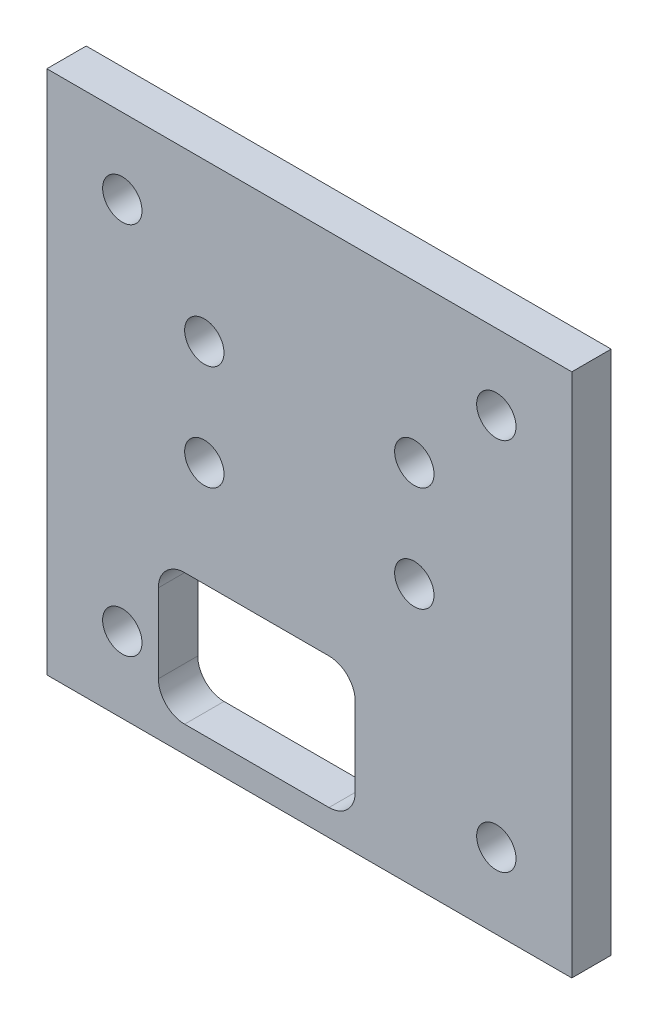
ISO-10303-21;
HEADER;
FILE_DESCRIPTION(('STEP AP214'),'2;1');
FILE_NAME('part.step','',(''),(''),'','','');
FILE_SCHEMA(('AUTOMOTIVE_DESIGN { 1 0 10303 214 1 1 1 1 }'));
ENDSEC;
DATA;
#1=APPLICATION_CONTEXT('core data for automotive mechanical design processes');
#2=APPLICATION_PROTOCOL_DEFINITION('international standard','automotive_design',2000,#1);
#3=PRODUCT_CONTEXT('',#1,'mechanical');
#4=PRODUCT('Part','Part','',(#3));
#5=PRODUCT_RELATED_PRODUCT_CATEGORY('part','',(#4));
#6=PRODUCT_DEFINITION_FORMATION('','',#4);
#7=PRODUCT_DEFINITION_CONTEXT('part definition',#1,'design');
#8=PRODUCT_DEFINITION('design','',#6,#7);
#9=PRODUCT_DEFINITION_SHAPE('','',#8);
#10=(LENGTH_UNIT() NAMED_UNIT(*) SI_UNIT(.MILLI.,.METRE.));
#11=(NAMED_UNIT(*) PLANE_ANGLE_UNIT() SI_UNIT($,.RADIAN.));
#12=(NAMED_UNIT(*) SI_UNIT($,.STERADIAN.) SOLID_ANGLE_UNIT());
#13=UNCERTAINTY_MEASURE_WITH_UNIT(LENGTH_MEASURE(1.E-05),#10,'distance_accuracy_value','');
#14=(GEOMETRIC_REPRESENTATION_CONTEXT(3) GLOBAL_UNCERTAINTY_ASSIGNED_CONTEXT((#13)) GLOBAL_UNIT_ASSIGNED_CONTEXT((#10,
#11,#12)) REPRESENTATION_CONTEXT('',''));
#15=CARTESIAN_POINT('',(0.,0.,0.));
#16=DIRECTION('',(0.,0.,1.));
#17=DIRECTION('',(1.,0.,0.));
#18=AXIS2_PLACEMENT_3D('',#15,#16,#17);
#19=CARTESIAN_POINT('',(20.,20.,3.));
#20=DIRECTION('',(-1.,0.,0.));
#21=DIRECTION('',(0.,-1.,0.));
#22=AXIS2_PLACEMENT_3D('',#19,#20,#21);
#23=PLANE('',#22);
#24=DIRECTION('',(0.,1.,0.));
#25=VECTOR('',#24,1.);
#26=CARTESIAN_POINT('',(20.,20.,0.));
#27=LINE('',#26,#25);
#28=CARTESIAN_POINT('',(20.,-20.,0.));
#29=VERTEX_POINT('',#28);
#30=CARTESIAN_POINT('',(20.,20.,0.));
#31=VERTEX_POINT('',#30);
#32=EDGE_CURVE('E148',#29,#31,#27,.T.);
#33=ORIENTED_EDGE('',*,*,#32,.T.);
#34=DIRECTION('',(0.,0.,-1.));
#35=VECTOR('',#34,1.);
#36=CARTESIAN_POINT('',(20.,20.,3.));
#37=LINE('',#36,#35);
#38=CARTESIAN_POINT('',(20.,20.,3.));
#39=VERTEX_POINT('',#38);
#40=EDGE_CURVE('E129',#39,#31,#37,.T.);
#41=ORIENTED_EDGE('',*,*,#40,.F.);
#42=DIRECTION('',(0.,1.,0.));
#43=VECTOR('',#42,1.);
#44=CARTESIAN_POINT('',(20.,20.,3.));
#45=LINE('',#44,#43);
#46=CARTESIAN_POINT('',(20.,-20.,3.));
#47=VERTEX_POINT('',#46);
#48=EDGE_CURVE('E136',#47,#39,#45,.T.);
#49=ORIENTED_EDGE('',*,*,#48,.F.);
#50=DIRECTION('',(0.,0.,-1.));
#51=VECTOR('',#50,1.);
#52=CARTESIAN_POINT('',(20.,-20.,3.));
#53=LINE('',#52,#51);
#54=EDGE_CURVE('E252',#47,#29,#53,.T.);
#55=ORIENTED_EDGE('',*,*,#54,.T.);
#56=EDGE_LOOP('',(#33,#41,#49,#55));
#57=FACE_BOUND('',#56,.T.);
#58=ADVANCED_FACE('F35',(#57),#23,.F.);
#59=CARTESIAN_POINT('',(-20.,20.,3.));
#60=DIRECTION('',(0.,-1.,0.));
#61=DIRECTION('',(0.,0.,-1.));
#62=AXIS2_PLACEMENT_3D('',#59,#60,#61);
#63=PLANE('',#62);
#64=DIRECTION('',(-1.,0.,0.));
#65=VECTOR('',#64,1.);
#66=CARTESIAN_POINT('',(-20.,20.,0.));
#67=LINE('',#66,#65);
#68=CARTESIAN_POINT('',(-20.,20.,0.));
#69=VERTEX_POINT('',#68);
#70=EDGE_CURVE('E254',#31,#69,#67,.T.);
#71=ORIENTED_EDGE('',*,*,#70,.T.);
#72=DIRECTION('',(0.,0.,-1.));
#73=VECTOR('',#72,1.);
#74=CARTESIAN_POINT('',(-20.,20.,3.));
#75=LINE('',#74,#73);
#76=CARTESIAN_POINT('',(-20.,20.,3.));
#77=VERTEX_POINT('',#76);
#78=EDGE_CURVE('E132',#77,#69,#75,.T.);
#79=ORIENTED_EDGE('',*,*,#78,.F.);
#80=DIRECTION('',(-1.,0.,0.));
#81=VECTOR('',#80,1.);
#82=CARTESIAN_POINT('',(-20.,20.,3.));
#83=LINE('',#82,#81);
#84=EDGE_CURVE('E125',#39,#77,#83,.T.);
#85=ORIENTED_EDGE('',*,*,#84,.F.);
#86=ORIENTED_EDGE('',*,*,#40,.T.);
#87=EDGE_LOOP('',(#71,#79,#85,#86));
#88=FACE_BOUND('',#87,.T.);
#89=ADVANCED_FACE('F127',(#88),#63,.F.);
#90=CARTESIAN_POINT('',(-20.,20.,3.));
#91=DIRECTION('',(1.,0.,0.));
#92=DIRECTION('',(0.,1.,0.));
#93=AXIS2_PLACEMENT_3D('',#90,#91,#92);
#94=PLANE('',#93);
#95=DIRECTION('',(0.,-1.,0.));
#96=VECTOR('',#95,1.);
#97=CARTESIAN_POINT('',(-20.,20.,0.));
#98=LINE('',#97,#96);
#99=CARTESIAN_POINT('',(-20.,-20.,0.));
#100=VERTEX_POINT('',#99);
#101=EDGE_CURVE('E256',#69,#100,#98,.T.);
#102=ORIENTED_EDGE('',*,*,#101,.T.);
#103=DIRECTION('',(0.,0.,-1.));
#104=VECTOR('',#103,1.);
#105=CARTESIAN_POINT('',(-20.,-20.,3.));
#106=LINE('',#105,#104);
#107=CARTESIAN_POINT('',(-20.,-20.,3.));
#108=VERTEX_POINT('',#107);
#109=EDGE_CURVE('E153',#108,#100,#106,.T.);
#110=ORIENTED_EDGE('',*,*,#109,.F.);
#111=DIRECTION('',(0.,-1.,0.));
#112=VECTOR('',#111,1.);
#113=CARTESIAN_POINT('',(-20.,20.,3.));
#114=LINE('',#113,#112);
#115=EDGE_CURVE('E135',#77,#108,#114,.T.);
#116=ORIENTED_EDGE('',*,*,#115,.F.);
#117=ORIENTED_EDGE('',*,*,#78,.T.);
#118=EDGE_LOOP('',(#102,#110,#116,#117));
#119=FACE_BOUND('',#118,.T.);
#120=ADVANCED_FACE('F267',(#119),#94,.F.);
#121=CARTESIAN_POINT('',(-20.,-20.,3.));
#122=DIRECTION('',(0.,1.,0.));
#123=DIRECTION('',(0.,0.,1.));
#124=AXIS2_PLACEMENT_3D('',#121,#122,#123);
#125=PLANE('',#124);
#126=DIRECTION('',(1.,0.,0.));
#127=VECTOR('',#126,1.);
#128=CARTESIAN_POINT('',(-20.,-20.,0.));
#129=LINE('',#128,#127);
#130=EDGE_CURVE('E145',#100,#29,#129,.T.);
#131=ORIENTED_EDGE('',*,*,#130,.T.);
#132=ORIENTED_EDGE('',*,*,#54,.F.);
#133=DIRECTION('',(1.,0.,0.));
#134=VECTOR('',#133,1.);
#135=CARTESIAN_POINT('',(-20.,-20.,3.));
#136=LINE('',#135,#134);
#137=EDGE_CURVE('E141',#108,#47,#136,.T.);
#138=ORIENTED_EDGE('',*,*,#137,.F.);
#139=ORIENTED_EDGE('',*,*,#109,.T.);
#140=EDGE_LOOP('',(#131,#132,#138,#139));
#141=FACE_BOUND('',#140,.T.);
#142=ADVANCED_FACE('F263',(#141),#125,.F.);
#143=CARTESIAN_POINT('',(0.,0.,3.));
#144=DIRECTION('',(0.,0.,1.));
#145=DIRECTION('',(1.,0.,0.));
#146=AXIS2_PLACEMENT_3D('',#143,#144,#145);
#147=PLANE('',#146);
#148=CARTESIAN_POINT('',(-8.,8.,3.));
#149=DIRECTION('',(0.,0.,1.));
#150=DIRECTION('',(1.,0.,0.));
#151=AXIS2_PLACEMENT_3D('',#148,#149,#150);
#152=CIRCLE('',#151,1.5);
#153=CARTESIAN_POINT('',(-6.5,8.,3.));
#154=VERTEX_POINT('',#153);
#155=EDGE_CURVE('E321',#154,#154,#152,.T.);
#156=ORIENTED_EDGE('',*,*,#155,.F.);
#157=EDGE_LOOP('',(#156));
#158=FACE_BOUND('',#157,.T.);
#159=CARTESIAN_POINT('',(-8.,0.,3.));
#160=DIRECTION('',(0.,0.,1.));
#161=DIRECTION('',(1.,0.,0.));
#162=AXIS2_PLACEMENT_3D('',#159,#160,#161);
#163=CIRCLE('',#162,1.5);
#164=CARTESIAN_POINT('',(-6.5,0.,3.));
#165=VERTEX_POINT('',#164);
#166=EDGE_CURVE('E315',#165,#165,#163,.T.);
#167=ORIENTED_EDGE('',*,*,#166,.F.);
#168=EDGE_LOOP('',(#167));
#169=FACE_BOUND('',#168,.T.);
#170=CARTESIAN_POINT('',(8.,0.,3.));
#171=DIRECTION('',(0.,0.,1.));
#172=DIRECTION('',(1.,0.,0.));
#173=AXIS2_PLACEMENT_3D('',#170,#171,#172);
#174=CIRCLE('',#173,1.5);
#175=CARTESIAN_POINT('',(9.5,0.,3.));
#176=VERTEX_POINT('',#175);
#177=EDGE_CURVE('E309',#176,#176,#174,.T.);
#178=ORIENTED_EDGE('',*,*,#177,.F.);
#179=EDGE_LOOP('',(#178));
#180=FACE_BOUND('',#179,.T.);
#181=CARTESIAN_POINT('',(8.,8.,3.));
#182=DIRECTION('',(0.,0.,1.));
#183=DIRECTION('',(1.,0.,0.));
#184=AXIS2_PLACEMENT_3D('',#181,#182,#183);
#185=CIRCLE('',#184,1.5);
#186=CARTESIAN_POINT('',(9.5,8.,3.));
#187=VERTEX_POINT('',#186);
#188=EDGE_CURVE('E303',#187,#187,#185,.T.);
#189=ORIENTED_EDGE('',*,*,#188,.F.);
#190=EDGE_LOOP('',(#189));
#191=FACE_BOUND('',#190,.T.);
#192=DIRECTION('',(0.,1.,0.));
#193=VECTOR('',#192,1.);
#194=CARTESIAN_POINT('',(3.5,-8.,3.));
#195=LINE('',#194,#193);
#196=CARTESIAN_POINT('',(3.5,-16.,3.));
#197=VERTEX_POINT('',#196);
#198=CARTESIAN_POINT('',(3.5,-10.,3.));
#199=VERTEX_POINT('',#198);
#200=EDGE_CURVE('E210',#197,#199,#195,.T.);
#201=ORIENTED_EDGE('',*,*,#200,.F.);
#202=CARTESIAN_POINT('',(1.5,-16.,3.));
#203=DIRECTION('',(0.,0.,1.));
#204=DIRECTION('',(1.,0.,0.));
#205=AXIS2_PLACEMENT_3D('',#202,#203,#204);
#206=CIRCLE('',#205,2.);
#207=CARTESIAN_POINT('',(1.5,-18.,3.));
#208=VERTEX_POINT('',#207);
#209=EDGE_CURVE('E191',#197,#208,#206,.F.);
#210=ORIENTED_EDGE('',*,*,#209,.T.);
#211=DIRECTION('',(1.,0.,0.));
#212=VECTOR('',#211,1.);
#213=CARTESIAN_POINT('',(-11.5,-18.,3.));
#214=LINE('',#213,#212);
#215=CARTESIAN_POINT('',(-9.5,-18.,3.));
#216=VERTEX_POINT('',#215);
#217=EDGE_CURVE('E233',#216,#208,#214,.T.);
#218=ORIENTED_EDGE('',*,*,#217,.F.);
#219=CARTESIAN_POINT('',(-9.5,-16.,3.));
#220=DIRECTION('',(0.,0.,1.));
#221=DIRECTION('',(1.,0.,0.));
#222=AXIS2_PLACEMENT_3D('',#219,#220,#221);
#223=CIRCLE('',#222,2.);
#224=CARTESIAN_POINT('',(-11.5,-16.,3.));
#225=VERTEX_POINT('',#224);
#226=EDGE_CURVE('E183',#216,#225,#223,.F.);
#227=ORIENTED_EDGE('',*,*,#226,.T.);
#228=DIRECTION('',(0.,-1.,0.));
#229=VECTOR('',#228,1.);
#230=CARTESIAN_POINT('',(-11.5,-8.,3.));
#231=LINE('',#230,#229);
#232=CARTESIAN_POINT('',(-11.5,-10.,3.));
#233=VERTEX_POINT('',#232);
#234=EDGE_CURVE('E201',#233,#225,#231,.T.);
#235=ORIENTED_EDGE('',*,*,#234,.F.);
#236=CARTESIAN_POINT('',(-9.5,-10.,3.));
#237=DIRECTION('',(0.,0.,1.));
#238=DIRECTION('',(1.,0.,0.));
#239=AXIS2_PLACEMENT_3D('',#236,#237,#238);
#240=CIRCLE('',#239,2.);
#241=CARTESIAN_POINT('',(-9.5,-8.,3.));
#242=VERTEX_POINT('',#241);
#243=EDGE_CURVE('E43',#233,#242,#240,.F.);
#244=ORIENTED_EDGE('',*,*,#243,.T.);
#245=DIRECTION('',(-1.,0.,0.));
#246=VECTOR('',#245,1.);
#247=CARTESIAN_POINT('',(-11.5,-8.,3.));
#248=LINE('',#247,#246);
#249=CARTESIAN_POINT('',(1.5,-8.,3.));
#250=VERTEX_POINT('',#249);
#251=EDGE_CURVE('E199',#250,#242,#248,.T.);
#252=ORIENTED_EDGE('',*,*,#251,.F.);
#253=CARTESIAN_POINT('',(1.5,-10.,3.));
#254=DIRECTION('',(0.,0.,1.));
#255=DIRECTION('',(1.,0.,0.));
#256=AXIS2_PLACEMENT_3D('',#253,#254,#255);
#257=CIRCLE('',#256,2.);
#258=EDGE_CURVE('E187',#250,#199,#257,.F.);
#259=ORIENTED_EDGE('',*,*,#258,.T.);
#260=EDGE_LOOP('',(#201,#210,#218,#227,#235,#244,#252,#259));
#261=FACE_BOUND('',#260,.T.);
#262=CARTESIAN_POINT('',(-14.25,14.25,3.));
#263=DIRECTION('',(0.,0.,1.));
#264=DIRECTION('',(1.,0.,0.));
#265=AXIS2_PLACEMENT_3D('',#262,#263,#264);
#266=CIRCLE('',#265,1.5);
#267=CARTESIAN_POINT('',(-12.75,14.25,3.));
#268=VERTEX_POINT('',#267);
#269=EDGE_CURVE('E165',#268,#268,#266,.T.);
#270=ORIENTED_EDGE('',*,*,#269,.F.);
#271=EDGE_LOOP('',(#270));
#272=FACE_BOUND('',#271,.T.);
#273=CARTESIAN_POINT('',(14.25,14.25,3.));
#274=DIRECTION('',(0.,0.,1.));
#275=DIRECTION('',(1.,0.,0.));
#276=AXIS2_PLACEMENT_3D('',#273,#274,#275);
#277=CIRCLE('',#276,1.5);
#278=CARTESIAN_POINT('',(15.75,14.25,3.));
#279=VERTEX_POINT('',#278);
#280=EDGE_CURVE('E164',#279,#279,#277,.T.);
#281=ORIENTED_EDGE('',*,*,#280,.F.);
#282=EDGE_LOOP('',(#281));
#283=FACE_BOUND('',#282,.T.);
#284=CARTESIAN_POINT('',(14.25,-14.25,3.));
#285=DIRECTION('',(0.,0.,1.));
#286=DIRECTION('',(1.,0.,0.));
#287=AXIS2_PLACEMENT_3D('',#284,#285,#286);
#288=CIRCLE('',#287,1.5);
#289=CARTESIAN_POINT('',(15.75,-14.25,3.));
#290=VERTEX_POINT('',#289);
#291=EDGE_CURVE('E161',#290,#290,#288,.T.);
#292=ORIENTED_EDGE('',*,*,#291,.F.);
#293=EDGE_LOOP('',(#292));
#294=FACE_BOUND('',#293,.T.);
#295=CARTESIAN_POINT('',(-14.25,-14.25,3.));
#296=DIRECTION('',(0.,0.,1.));
#297=DIRECTION('',(1.,0.,0.));
#298=AXIS2_PLACEMENT_3D('',#295,#296,#297);
#299=CIRCLE('',#298,1.5);
#300=CARTESIAN_POINT('',(-12.75,-14.25,3.));
#301=VERTEX_POINT('',#300);
#302=EDGE_CURVE('E160',#301,#301,#299,.T.);
#303=ORIENTED_EDGE('',*,*,#302,.F.);
#304=EDGE_LOOP('',(#303));
#305=FACE_BOUND('',#304,.T.);
#306=ORIENTED_EDGE('',*,*,#48,.T.);
#307=ORIENTED_EDGE('',*,*,#84,.T.);
#308=ORIENTED_EDGE('',*,*,#115,.T.);
#309=ORIENTED_EDGE('',*,*,#137,.T.);
#310=EDGE_LOOP('',(#306,#307,#308,#309));
#311=FACE_BOUND('',#310,.T.);
#312=ADVANCED_FACE('F139',(#158,#169,#180,#191,#261,#272,#283,#294,#305,#311),#147,.T.);
#313=CARTESIAN_POINT('',(0.,0.,0.));
#314=DIRECTION('',(0.,0.,1.));
#315=DIRECTION('',(1.,0.,0.));
#316=AXIS2_PLACEMENT_3D('',#313,#314,#315);
#317=PLANE('',#316);
#318=CARTESIAN_POINT('',(-8.,8.,0.));
#319=DIRECTION('',(0.,0.,1.));
#320=DIRECTION('',(1.,0.,0.));
#321=AXIS2_PLACEMENT_3D('',#318,#319,#320);
#322=CIRCLE('',#321,1.5);
#323=CARTESIAN_POINT('',(-6.5,8.,0.));
#324=VERTEX_POINT('',#323);
#325=EDGE_CURVE('E318',#324,#324,#322,.T.);
#326=ORIENTED_EDGE('',*,*,#325,.T.);
#327=EDGE_LOOP('',(#326));
#328=FACE_BOUND('',#327,.T.);
#329=CARTESIAN_POINT('',(-8.,0.,0.));
#330=DIRECTION('',(0.,0.,1.));
#331=DIRECTION('',(1.,0.,0.));
#332=AXIS2_PLACEMENT_3D('',#329,#330,#331);
#333=CIRCLE('',#332,1.5);
#334=CARTESIAN_POINT('',(-6.5,0.,0.));
#335=VERTEX_POINT('',#334);
#336=EDGE_CURVE('E312',#335,#335,#333,.T.);
#337=ORIENTED_EDGE('',*,*,#336,.T.);
#338=EDGE_LOOP('',(#337));
#339=FACE_BOUND('',#338,.T.);
#340=CARTESIAN_POINT('',(8.,0.,0.));
#341=DIRECTION('',(0.,0.,1.));
#342=DIRECTION('',(1.,0.,0.));
#343=AXIS2_PLACEMENT_3D('',#340,#341,#342);
#344=CIRCLE('',#343,1.5);
#345=CARTESIAN_POINT('',(9.5,0.,0.));
#346=VERTEX_POINT('',#345);
#347=EDGE_CURVE('E306',#346,#346,#344,.T.);
#348=ORIENTED_EDGE('',*,*,#347,.T.);
#349=EDGE_LOOP('',(#348));
#350=FACE_BOUND('',#349,.T.);
#351=CARTESIAN_POINT('',(8.,8.,0.));
#352=DIRECTION('',(0.,0.,1.));
#353=DIRECTION('',(1.,0.,0.));
#354=AXIS2_PLACEMENT_3D('',#351,#352,#353);
#355=CIRCLE('',#354,1.5);
#356=CARTESIAN_POINT('',(9.5,8.,0.));
#357=VERTEX_POINT('',#356);
#358=EDGE_CURVE('E230',#357,#357,#355,.T.);
#359=ORIENTED_EDGE('',*,*,#358,.T.);
#360=EDGE_LOOP('',(#359));
#361=FACE_BOUND('',#360,.T.);
#362=DIRECTION('',(0.,-1.,0.));
#363=VECTOR('',#362,1.);
#364=CARTESIAN_POINT('',(-11.5,-8.,0.));
#365=LINE('',#364,#363);
#366=CARTESIAN_POINT('',(-11.5,-10.,0.));
#367=VERTEX_POINT('',#366);
#368=CARTESIAN_POINT('',(-11.5,-16.,0.));
#369=VERTEX_POINT('',#368);
#370=EDGE_CURVE('E217',#367,#369,#365,.T.);
#371=ORIENTED_EDGE('',*,*,#370,.T.);
#372=CARTESIAN_POINT('',(-9.5,-16.,0.));
#373=DIRECTION('',(0.,0.,1.));
#374=DIRECTION('',(1.,0.,0.));
#375=AXIS2_PLACEMENT_3D('',#372,#373,#374);
#376=CIRCLE('',#375,2.);
#377=CARTESIAN_POINT('',(-9.5,-18.,0.));
#378=VERTEX_POINT('',#377);
#379=EDGE_CURVE('E185',#369,#378,#376,.T.);
#380=ORIENTED_EDGE('',*,*,#379,.T.);
#381=DIRECTION('',(1.,0.,0.));
#382=VECTOR('',#381,1.);
#383=CARTESIAN_POINT('',(-11.5,-18.,0.));
#384=LINE('',#383,#382);
#385=CARTESIAN_POINT('',(1.5,-18.,0.));
#386=VERTEX_POINT('',#385);
#387=EDGE_CURVE('E223',#378,#386,#384,.T.);
#388=ORIENTED_EDGE('',*,*,#387,.T.);
#389=CARTESIAN_POINT('',(1.5,-16.,0.));
#390=DIRECTION('',(0.,0.,1.));
#391=DIRECTION('',(1.,0.,0.));
#392=AXIS2_PLACEMENT_3D('',#389,#390,#391);
#393=CIRCLE('',#392,2.);
#394=CARTESIAN_POINT('',(3.5,-16.,0.));
#395=VERTEX_POINT('',#394);
#396=EDGE_CURVE('E57',#386,#395,#393,.T.);
#397=ORIENTED_EDGE('',*,*,#396,.T.);
#398=DIRECTION('',(0.,1.,0.));
#399=VECTOR('',#398,1.);
#400=CARTESIAN_POINT('',(3.5,-8.,0.));
#401=LINE('',#400,#399);
#402=CARTESIAN_POINT('',(3.5,-10.,0.));
#403=VERTEX_POINT('',#402);
#404=EDGE_CURVE('E226',#395,#403,#401,.T.);
#405=ORIENTED_EDGE('',*,*,#404,.T.);
#406=CARTESIAN_POINT('',(1.5,-10.,0.));
#407=DIRECTION('',(0.,0.,1.));
#408=DIRECTION('',(1.,0.,0.));
#409=AXIS2_PLACEMENT_3D('',#406,#407,#408);
#410=CIRCLE('',#409,2.);
#411=CARTESIAN_POINT('',(1.5,-8.,0.));
#412=VERTEX_POINT('',#411);
#413=EDGE_CURVE('E189',#403,#412,#410,.T.);
#414=ORIENTED_EDGE('',*,*,#413,.T.);
#415=DIRECTION('',(-1.,0.,0.));
#416=VECTOR('',#415,1.);
#417=CARTESIAN_POINT('',(-11.5,-8.,0.));
#418=LINE('',#417,#416);
#419=CARTESIAN_POINT('',(-9.5,-8.,0.));
#420=VERTEX_POINT('',#419);
#421=EDGE_CURVE('E219',#412,#420,#418,.T.);
#422=ORIENTED_EDGE('',*,*,#421,.T.);
#423=CARTESIAN_POINT('',(-9.5,-10.,0.));
#424=DIRECTION('',(0.,0.,1.));
#425=DIRECTION('',(1.,0.,0.));
#426=AXIS2_PLACEMENT_3D('',#423,#424,#425);
#427=CIRCLE('',#426,2.);
#428=EDGE_CURVE('E11',#420,#367,#427,.T.);
#429=ORIENTED_EDGE('',*,*,#428,.T.);
#430=EDGE_LOOP('',(#371,#380,#388,#397,#405,#414,#422,#429));
#431=FACE_BOUND('',#430,.T.);
#432=CARTESIAN_POINT('',(-14.25,14.25,0.));
#433=DIRECTION('',(0.,0.,1.));
#434=DIRECTION('',(1.,0.,0.));
#435=AXIS2_PLACEMENT_3D('',#432,#433,#434);
#436=CIRCLE('',#435,1.5);
#437=CARTESIAN_POINT('',(-12.75,14.25,0.));
#438=VERTEX_POINT('',#437);
#439=EDGE_CURVE('E162',#438,#438,#436,.T.);
#440=ORIENTED_EDGE('',*,*,#439,.T.);
#441=EDGE_LOOP('',(#440));
#442=FACE_BOUND('',#441,.T.);
#443=CARTESIAN_POINT('',(14.25,14.25,0.));
#444=DIRECTION('',(0.,0.,1.));
#445=DIRECTION('',(1.,0.,0.));
#446=AXIS2_PLACEMENT_3D('',#443,#444,#445);
#447=CIRCLE('',#446,1.5);
#448=CARTESIAN_POINT('',(15.75,14.25,0.));
#449=VERTEX_POINT('',#448);
#450=EDGE_CURVE('E240',#449,#449,#447,.T.);
#451=ORIENTED_EDGE('',*,*,#450,.T.);
#452=EDGE_LOOP('',(#451));
#453=FACE_BOUND('',#452,.T.);
#454=CARTESIAN_POINT('',(14.25,-14.25,0.));
#455=DIRECTION('',(0.,0.,1.));
#456=DIRECTION('',(1.,0.,0.));
#457=AXIS2_PLACEMENT_3D('',#454,#455,#456);
#458=CIRCLE('',#457,1.5);
#459=CARTESIAN_POINT('',(15.75,-14.25,0.));
#460=VERTEX_POINT('',#459);
#461=EDGE_CURVE('E157',#460,#460,#458,.T.);
#462=ORIENTED_EDGE('',*,*,#461,.T.);
#463=EDGE_LOOP('',(#462));
#464=FACE_BOUND('',#463,.T.);
#465=CARTESIAN_POINT('',(-14.25,-14.25,0.));
#466=DIRECTION('',(0.,0.,1.));
#467=DIRECTION('',(1.,0.,0.));
#468=AXIS2_PLACEMENT_3D('',#465,#466,#467);
#469=CIRCLE('',#468,1.5);
#470=CARTESIAN_POINT('',(-12.75,-14.25,0.));
#471=VERTEX_POINT('',#470);
#472=EDGE_CURVE('E247',#471,#471,#469,.T.);
#473=ORIENTED_EDGE('',*,*,#472,.T.);
#474=EDGE_LOOP('',(#473));
#475=FACE_BOUND('',#474,.T.);
#476=ORIENTED_EDGE('',*,*,#32,.F.);
#477=ORIENTED_EDGE('',*,*,#130,.F.);
#478=ORIENTED_EDGE('',*,*,#101,.F.);
#479=ORIENTED_EDGE('',*,*,#70,.F.);
#480=EDGE_LOOP('',(#476,#477,#478,#479));
#481=FACE_BOUND('',#480,.T.);
#482=ADVANCED_FACE('F215',(#328,#339,#350,#361,#431,#442,#453,#464,#475,#481),#317,.F.);
#483=CARTESIAN_POINT('',(-14.25,-14.25,3.));
#484=DIRECTION('',(0.,0.,1.));
#485=DIRECTION('',(1.,0.,0.));
#486=AXIS2_PLACEMENT_3D('',#483,#484,#485);
#487=CYLINDRICAL_SURFACE('',#486,1.5);
#488=ORIENTED_EDGE('',*,*,#302,.T.);
#489=EDGE_LOOP('',(#488));
#490=FACE_BOUND('',#489,.T.);
#491=ORIENTED_EDGE('',*,*,#472,.F.);
#492=EDGE_LOOP('',(#491));
#493=FACE_BOUND('',#492,.T.);
#494=ADVANCED_FACE('F370',(#490,#493),#487,.F.);
#495=CARTESIAN_POINT('',(14.25,-14.25,3.));
#496=DIRECTION('',(0.,0.,1.));
#497=DIRECTION('',(1.,0.,0.));
#498=AXIS2_PLACEMENT_3D('',#495,#496,#497);
#499=CYLINDRICAL_SURFACE('',#498,1.5);
#500=ORIENTED_EDGE('',*,*,#291,.T.);
#501=EDGE_LOOP('',(#500));
#502=FACE_BOUND('',#501,.T.);
#503=ORIENTED_EDGE('',*,*,#461,.F.);
#504=EDGE_LOOP('',(#503));
#505=FACE_BOUND('',#504,.T.);
#506=ADVANCED_FACE('F366',(#502,#505),#499,.F.);
#507=CARTESIAN_POINT('',(14.25,14.25,3.));
#508=DIRECTION('',(0.,0.,1.));
#509=DIRECTION('',(1.,0.,0.));
#510=AXIS2_PLACEMENT_3D('',#507,#508,#509);
#511=CYLINDRICAL_SURFACE('',#510,1.5);
#512=ORIENTED_EDGE('',*,*,#280,.T.);
#513=EDGE_LOOP('',(#512));
#514=FACE_BOUND('',#513,.T.);
#515=ORIENTED_EDGE('',*,*,#450,.F.);
#516=EDGE_LOOP('',(#515));
#517=FACE_BOUND('',#516,.T.);
#518=ADVANCED_FACE('F362',(#514,#517),#511,.F.);
#519=CARTESIAN_POINT('',(-14.25,14.25,3.));
#520=DIRECTION('',(0.,0.,1.));
#521=DIRECTION('',(1.,0.,0.));
#522=AXIS2_PLACEMENT_3D('',#519,#520,#521);
#523=CYLINDRICAL_SURFACE('',#522,1.5);
#524=ORIENTED_EDGE('',*,*,#269,.T.);
#525=EDGE_LOOP('',(#524));
#526=FACE_BOUND('',#525,.T.);
#527=ORIENTED_EDGE('',*,*,#439,.F.);
#528=EDGE_LOOP('',(#527));
#529=FACE_BOUND('',#528,.T.);
#530=ADVANCED_FACE('F359',(#526,#529),#523,.F.);
#531=CARTESIAN_POINT('',(3.5,-8.,0.));
#532=DIRECTION('',(1.,0.,0.));
#533=DIRECTION('',(0.,1.,0.));
#534=AXIS2_PLACEMENT_3D('',#531,#532,#533);
#535=PLANE('',#534);
#536=ORIENTED_EDGE('',*,*,#200,.T.);
#537=DIRECTION('',(0.,0.,1.));
#538=VECTOR('',#537,1.);
#539=CARTESIAN_POINT('',(3.5,-10.,0.));
#540=LINE('',#539,#538);
#541=EDGE_CURVE('E50',#199,#403,#540,.F.);
#542=ORIENTED_EDGE('',*,*,#541,.T.);
#543=ORIENTED_EDGE('',*,*,#404,.F.);
#544=DIRECTION('',(0.,0.,1.));
#545=VECTOR('',#544,1.);
#546=CARTESIAN_POINT('',(3.5,-16.,3.));
#547=LINE('',#546,#545);
#548=EDGE_CURVE('E179',#395,#197,#547,.T.);
#549=ORIENTED_EDGE('',*,*,#548,.T.);
#550=EDGE_LOOP('',(#536,#542,#543,#549));
#551=FACE_BOUND('',#550,.T.);
#552=ADVANCED_FACE('F297',(#551),#535,.F.);
#553=CARTESIAN_POINT('',(-11.5,-18.,0.));
#554=DIRECTION('',(0.,-1.,0.));
#555=DIRECTION('',(0.,0.,-1.));
#556=AXIS2_PLACEMENT_3D('',#553,#554,#555);
#557=PLANE('',#556);
#558=ORIENTED_EDGE('',*,*,#387,.F.);
#559=DIRECTION('',(0.,0.,1.));
#560=VECTOR('',#559,1.);
#561=CARTESIAN_POINT('',(-9.5,-18.,3.));
#562=LINE('',#561,#560);
#563=EDGE_CURVE('E151',#378,#216,#562,.T.);
#564=ORIENTED_EDGE('',*,*,#563,.T.);
#565=ORIENTED_EDGE('',*,*,#217,.T.);
#566=DIRECTION('',(0.,0.,1.));
#567=VECTOR('',#566,1.);
#568=CARTESIAN_POINT('',(1.5,-18.,0.));
#569=LINE('',#568,#567);
#570=EDGE_CURVE('E149',#208,#386,#569,.F.);
#571=ORIENTED_EDGE('',*,*,#570,.T.);
#572=EDGE_LOOP('',(#558,#564,#565,#571));
#573=FACE_BOUND('',#572,.T.);
#574=ADVANCED_FACE('F349',(#573),#557,.F.);
#575=CARTESIAN_POINT('',(-11.5,-8.,0.));
#576=DIRECTION('',(-1.,0.,0.));
#577=DIRECTION('',(0.,-1.,0.));
#578=AXIS2_PLACEMENT_3D('',#575,#576,#577);
#579=PLANE('',#578);
#580=ORIENTED_EDGE('',*,*,#234,.T.);
#581=DIRECTION('',(0.,0.,1.));
#582=VECTOR('',#581,1.);
#583=CARTESIAN_POINT('',(-11.5,-16.,0.));
#584=LINE('',#583,#582);
#585=EDGE_CURVE('E172',#225,#369,#584,.F.);
#586=ORIENTED_EDGE('',*,*,#585,.T.);
#587=ORIENTED_EDGE('',*,*,#370,.F.);
#588=DIRECTION('',(0.,0.,1.));
#589=VECTOR('',#588,1.);
#590=CARTESIAN_POINT('',(-11.5,-10.,3.));
#591=LINE('',#590,#589);
#592=EDGE_CURVE('E169',#367,#233,#591,.T.);
#593=ORIENTED_EDGE('',*,*,#592,.T.);
#594=EDGE_LOOP('',(#580,#586,#587,#593));
#595=FACE_BOUND('',#594,.T.);
#596=ADVANCED_FACE('F221',(#595),#579,.F.);
#597=CARTESIAN_POINT('',(-11.5,-8.,0.));
#598=DIRECTION('',(0.,1.,0.));
#599=DIRECTION('',(0.,0.,1.));
#600=AXIS2_PLACEMENT_3D('',#597,#598,#599);
#601=PLANE('',#600);
#602=ORIENTED_EDGE('',*,*,#421,.F.);
#603=DIRECTION('',(0.,0.,1.));
#604=VECTOR('',#603,1.);
#605=CARTESIAN_POINT('',(1.5,-8.,3.));
#606=LINE('',#605,#604);
#607=EDGE_CURVE('E176',#412,#250,#606,.T.);
#608=ORIENTED_EDGE('',*,*,#607,.T.);
#609=ORIENTED_EDGE('',*,*,#251,.T.);
#610=DIRECTION('',(0.,0.,1.));
#611=VECTOR('',#610,1.);
#612=CARTESIAN_POINT('',(-9.5,-8.,0.));
#613=LINE('',#612,#611);
#614=EDGE_CURVE('E174',#242,#420,#613,.F.);
#615=ORIENTED_EDGE('',*,*,#614,.T.);
#616=EDGE_LOOP('',(#602,#608,#609,#615));
#617=FACE_BOUND('',#616,.T.);
#618=ADVANCED_FACE('F207',(#617),#601,.F.);
#619=CARTESIAN_POINT('',(-9.5,-16.,0.));
#620=DIRECTION('',(0.,0.,-1.));
#621=DIRECTION('',(-1.,0.,0.));
#622=AXIS2_PLACEMENT_3D('',#619,#620,#621);
#623=CYLINDRICAL_SURFACE('',#622,2.);
#624=ORIENTED_EDGE('',*,*,#379,.F.);
#625=ORIENTED_EDGE('',*,*,#585,.F.);
#626=ORIENTED_EDGE('',*,*,#226,.F.);
#627=ORIENTED_EDGE('',*,*,#563,.F.);
#628=EDGE_LOOP('',(#624,#625,#626,#627));
#629=FACE_BOUND('',#628,.T.);
#630=ADVANCED_FACE('F281',(#629),#623,.F.);
#631=CARTESIAN_POINT('',(1.5,-10.,0.));
#632=DIRECTION('',(0.,0.,-1.));
#633=DIRECTION('',(-1.,0.,0.));
#634=AXIS2_PLACEMENT_3D('',#631,#632,#633);
#635=CYLINDRICAL_SURFACE('',#634,2.);
#636=ORIENTED_EDGE('',*,*,#413,.F.);
#637=ORIENTED_EDGE('',*,*,#541,.F.);
#638=ORIENTED_EDGE('',*,*,#258,.F.);
#639=ORIENTED_EDGE('',*,*,#607,.F.);
#640=EDGE_LOOP('',(#636,#637,#638,#639));
#641=FACE_BOUND('',#640,.T.);
#642=ADVANCED_FACE('F284',(#641),#635,.F.);
#643=CARTESIAN_POINT('',(1.5,-16.,0.));
#644=DIRECTION('',(0.,0.,-1.));
#645=DIRECTION('',(-1.,0.,0.));
#646=AXIS2_PLACEMENT_3D('',#643,#644,#645);
#647=CYLINDRICAL_SURFACE('',#646,2.);
#648=ORIENTED_EDGE('',*,*,#396,.F.);
#649=ORIENTED_EDGE('',*,*,#570,.F.);
#650=ORIENTED_EDGE('',*,*,#209,.F.);
#651=ORIENTED_EDGE('',*,*,#548,.F.);
#652=EDGE_LOOP('',(#648,#649,#650,#651));
#653=FACE_BOUND('',#652,.T.);
#654=ADVANCED_FACE('F287',(#653),#647,.F.);
#655=CARTESIAN_POINT('',(-9.5,-10.,0.));
#656=DIRECTION('',(0.,0.,-1.));
#657=DIRECTION('',(-1.,0.,0.));
#658=AXIS2_PLACEMENT_3D('',#655,#656,#657);
#659=CYLINDRICAL_SURFACE('',#658,2.);
#660=ORIENTED_EDGE('',*,*,#428,.F.);
#661=ORIENTED_EDGE('',*,*,#614,.F.);
#662=ORIENTED_EDGE('',*,*,#243,.F.);
#663=ORIENTED_EDGE('',*,*,#592,.F.);
#664=EDGE_LOOP('',(#660,#661,#662,#663));
#665=FACE_BOUND('',#664,.T.);
#666=ADVANCED_FACE('F37',(#665),#659,.F.);
#667=CARTESIAN_POINT('',(8.,8.,3.));
#668=DIRECTION('',(0.,0.,1.));
#669=DIRECTION('',(1.,0.,0.));
#670=AXIS2_PLACEMENT_3D('',#667,#668,#669);
#671=CYLINDRICAL_SURFACE('',#670,1.5);
#672=ORIENTED_EDGE('',*,*,#358,.F.);
#673=EDGE_LOOP('',(#672));
#674=FACE_BOUND('',#673,.T.);
#675=ORIENTED_EDGE('',*,*,#188,.T.);
#676=EDGE_LOOP('',(#675));
#677=FACE_BOUND('',#676,.T.);
#678=ADVANCED_FACE('F294',(#674,#677),#671,.F.);
#679=CARTESIAN_POINT('',(8.,0.,3.));
#680=DIRECTION('',(0.,0.,1.));
#681=DIRECTION('',(1.,0.,0.));
#682=AXIS2_PLACEMENT_3D('',#679,#680,#681);
#683=CYLINDRICAL_SURFACE('',#682,1.5);
#684=ORIENTED_EDGE('',*,*,#347,.F.);
#685=EDGE_LOOP('',(#684));
#686=FACE_BOUND('',#685,.T.);
#687=ORIENTED_EDGE('',*,*,#177,.T.);
#688=EDGE_LOOP('',(#687));
#689=FACE_BOUND('',#688,.T.);
#690=ADVANCED_FACE('F337',(#686,#689),#683,.F.);
#691=CARTESIAN_POINT('',(-8.,0.,3.));
#692=DIRECTION('',(0.,0.,1.));
#693=DIRECTION('',(1.,0.,0.));
#694=AXIS2_PLACEMENT_3D('',#691,#692,#693);
#695=CYLINDRICAL_SURFACE('',#694,1.5);
#696=ORIENTED_EDGE('',*,*,#336,.F.);
#697=EDGE_LOOP('',(#696));
#698=FACE_BOUND('',#697,.T.);
#699=ORIENTED_EDGE('',*,*,#166,.T.);
#700=EDGE_LOOP('',(#699));
#701=FACE_BOUND('',#700,.T.);
#702=ADVANCED_FACE('F343',(#698,#701),#695,.F.);
#703=CARTESIAN_POINT('',(-8.,8.,3.));
#704=DIRECTION('',(0.,0.,1.));
#705=DIRECTION('',(1.,0.,0.));
#706=AXIS2_PLACEMENT_3D('',#703,#704,#705);
#707=CYLINDRICAL_SURFACE('',#706,1.5);
#708=ORIENTED_EDGE('',*,*,#325,.F.);
#709=EDGE_LOOP('',(#708));
#710=FACE_BOUND('',#709,.T.);
#711=ORIENTED_EDGE('',*,*,#155,.T.);
#712=EDGE_LOOP('',(#711));
#713=FACE_BOUND('',#712,.T.);
#714=ADVANCED_FACE('F325',(#710,#713),#707,.F.);
#715=CLOSED_SHELL('',(#58,#89,#120,#142,#312,#482,#494,#506,#518,#530,#552,#574,#596,#618,#630,
#642,#654,#666,#678,#690,#702,#714));
#716=MANIFOLD_SOLID_BREP('B2',#715);
#717=ADVANCED_BREP_SHAPE_REPRESENTATION('',(#18,#716),#14);
#718=SHAPE_DEFINITION_REPRESENTATION(#9,#717);
ENDSEC;
END-ISO-10303-21;
